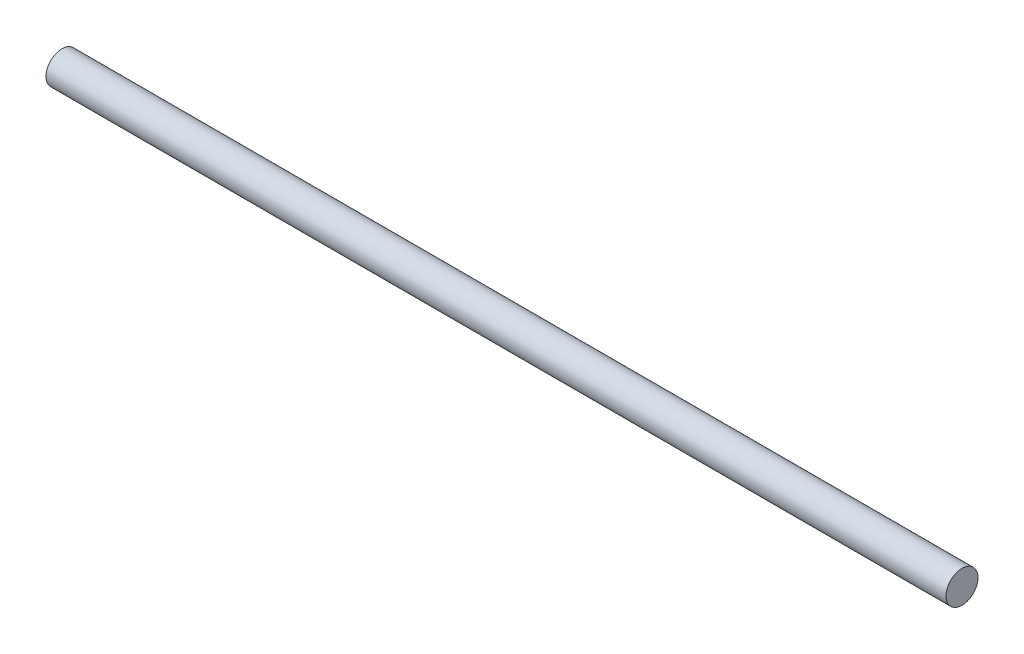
from build123d import *

# Parameters (mm, degrees)
SKETCH1_R           = 4
BOSS_EXTRUDE1_DEPTH = 225


with BuildPart() as part:
    # Sketch1 → Boss-Extrude1 (new body)
    with BuildSketch(Plane(origin=(0, 0, 0), x_dir=(0, 0, -1), z_dir=(1, 0, 0))):
        with Locations((0, -6.371412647)):
            Circle(SKETCH1_R)
    extrude(amount=BOSS_EXTRUDE1_DEPTH)


solid = part.part
